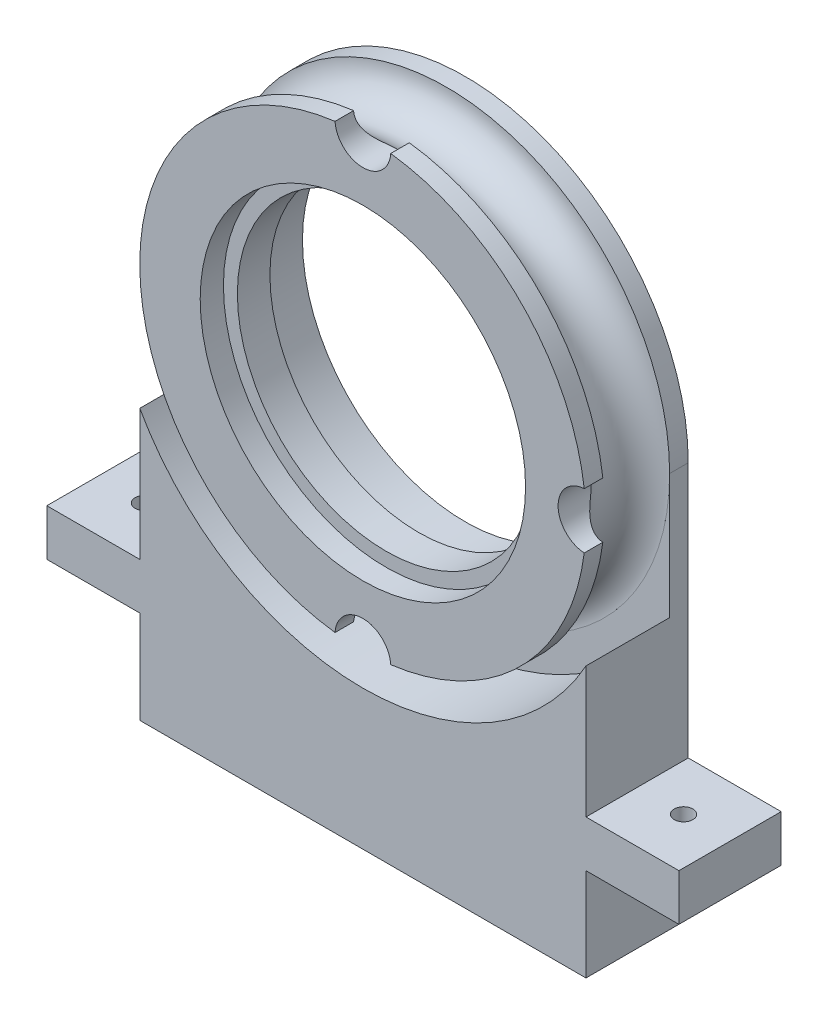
from build123d import *
from build123d.topology import SkipClean

# Parameters (mm, degrees)
SKETCH1_R             = 17.5
BOSS_EXTRUDE1_DEPTH   = 11
SKETCH3_R             = 24
SKETCH3_R_2           = 16
BOSS_EXTRUDE3_DEPTH   = 8.5
BOSS_EXTRUDE4_START   = -3
SKETCH4_R             = 24
SKETCH4_R_2           = 19
BOSS_EXTRUDE4_DEPTH   = 3
CUT_EXTRUDE1_START    = -7
CUT_EXTRUDE1_DEPTH    = 7
CROQUIS1_R            = 17.5
CORTAR_EXTRUIR1_DEPTH = 5
CROQUIS3_R            = 1
CORTAR_EXTRUIR3_DEPTH = 10
CROQUIS17_R           = 3.5
CORTAR_EXTRUIR4_START = -9
CORTAR_EXTRUIR4_DEPTH = 9


with BuildPart() as part:
    # Sketch1 → Boss-Extrude1 (new body)
    with BuildSketch(Plane.XY):
        with BuildLine():
            Line((-34, -27.5), (-34, -32.5))
            Line((-34, -32.5), (-24, -32.5))
            Line((-24, -32.5), (-24, -42.5))
            Line((-24, -42.5), (24, -42.5))
            Line((24, -42.5), (24, -32.5))
            Line((24, -32.5), (34, -32.5))
            Line((34, -32.5), (34, -27.5))
            Line((34, -27.5), (24, -27.5))
            Line((24, -27.5), (24, 0))
            ThreePointArc((24, 0), (0, 24), (-24, 0))
            Line((-24, 0), (-24, -27.5))
            Line((-24, -27.5), (-34, -27.5))
        make_face()
        Circle(SKETCH1_R, mode=Mode.SUBTRACT)
    extrude(amount=BOSS_EXTRUDE1_DEPTH)

    # Sketch3 → Boss-Extrude3 (add)
    with BuildSketch(Plane(origin=(0, 0, 0), x_dir=(-1, 0, 0), z_dir=(0, 0, -1))):
        Circle(SKETCH3_R)
        Circle(SKETCH3_R_2, mode=Mode.SUBTRACT)
    extrude(amount=-BOSS_EXTRUDE3_DEPTH)

    # Sketch4 → Boss-Extrude4 (add)
    with BuildSketch(Plane.XY.offset(8.5).offset(BOSS_EXTRUDE4_START)):
        Circle(SKETCH4_R)
        Circle(SKETCH4_R_2, mode=Mode.SUBTRACT)
    extrude(amount=BOSS_EXTRUDE4_DEPTH)

    # Sketch6 → Cut-Extrude1 (cut)
    with BuildSketch(Plane.XY.offset(11).offset(CUT_EXTRUDE1_START)):
        with BuildLine():
            ThreePointArc((-2.994134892, 23.8125), (0, 21), (2.994134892, 23.8125))
            ThreePointArc((2.994134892, 23.8125), (0, 24), (-2.994134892, 23.8125))
        make_face()
        with BuildLine():
            ThreePointArc((23.8125, 2.994134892), (21, 0), (23.8125, -2.994134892))
            ThreePointArc((23.8125, -2.994134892), (24, 0), (23.8125, 2.994134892))
        make_face()
        with BuildLine():
            ThreePointArc((2.994134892, -23.8125), (0, -21), (-2.994134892, -23.8125))
            ThreePointArc((-2.994134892, -23.8125), (0, -24), (2.994134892, -23.8125))
        make_face()
    extrude(amount=CUT_EXTRUDE1_DEPTH, mode=Mode.SUBTRACT)

    # Croquis1 → Cortar-Extruir1 (cut)
    with BuildSketch(Plane(origin=(0, 0, 0), x_dir=(-1, 0, 0), z_dir=(0, 0, -1))):
        Circle(CROQUIS1_R)
    extrude(amount=-CORTAR_EXTRUIR1_DEPTH, mode=Mode.SUBTRACT)

    # Croquis3 → Cortar-Extruir3 (cut)
    with BuildSketch(Plane(origin=(0, -27.5, 0), x_dir=(1, 0, 0), z_dir=(0, 1, 0))):
        with Locations(Location((-29, -5.5, 0), (0, 0, 180))):
            Circle(CROQUIS3_R)
        with Locations(Location((29, -5.5, 0), (0, 0, 180))):
            Circle(CROQUIS3_R)
    extrude(amount=-CORTAR_EXTRUIR3_DEPTH, mode=Mode.SUBTRACT)

    # Croquis17 → Cortar-Revoluci_n2 (revolve, cut)
    with SkipClean():  # the faces are left unmerged after this step: merging them gives an invalid solid
        with BuildSketch(Plane(origin=(0, 0, 0), x_dir=(1, 0, 0), z_dir=(0, 1, 0)), mode=Mode.PRIVATE) as cortar_revoluci_n2_sk:
            with Locations((23.91, -5.5)):
                Circle(CROQUIS17_R)
        revolve(cortar_revoluci_n2_sk.sketch.rotate(Axis((0, 0, 0), (0, 0, 1)), 180), axis=Axis((0, 0, 0), (0, 0, 1)), mode=Mode.SUBTRACT)

    # Croquis18 → Cortar-Extruir4 (cut)
    with SkipClean():  # the faces are left unmerged after this step: merging them gives an invalid solid
        with BuildSketch(Plane.XY.offset(11).offset(CORTAR_EXTRUIR4_START)):
            with BuildLine():
                Line((-24, 0), (-24, -13.425721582))
                ThreePointArc((-24, -13.425721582), (0, -27.5), (24, -13.425721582))
                Line((24, -13.425721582), (24, 0))
                ThreePointArc((24, 0), (0, -24), (-24, 0))
            make_face()
        extrude(amount=CORTAR_EXTRUIR4_DEPTH, mode=Mode.SUBTRACT)


solid = part.part
